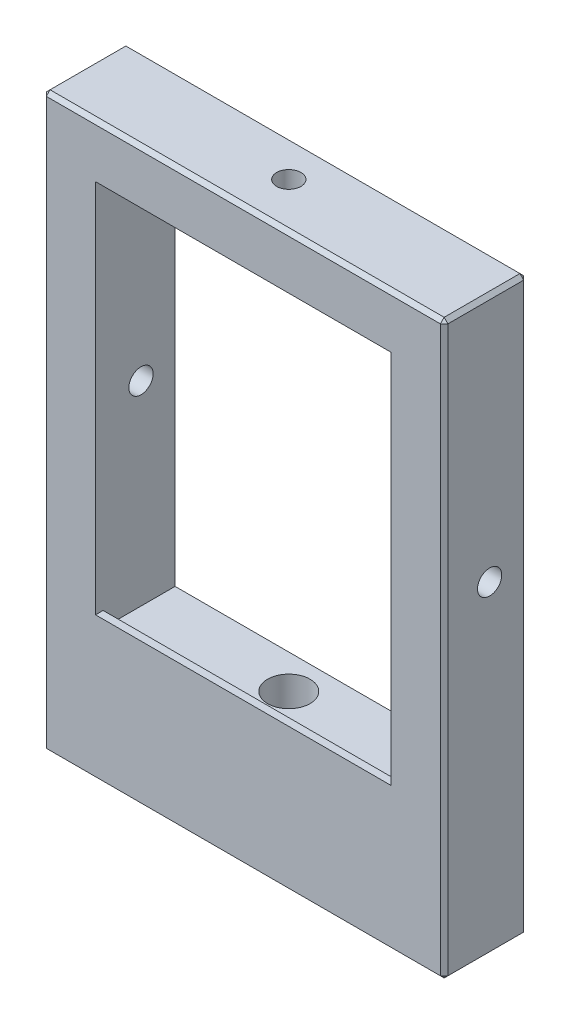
ISO-10303-21;
HEADER;
FILE_DESCRIPTION(('STEP AP214'),'2;1');
FILE_NAME('part.step','',(''),(''),'','','');
FILE_SCHEMA(('AUTOMOTIVE_DESIGN { 1 0 10303 214 1 1 1 1 }'));
ENDSEC;
DATA;
#1=APPLICATION_CONTEXT('core data for automotive mechanical design processes');
#2=APPLICATION_PROTOCOL_DEFINITION('international standard','automotive_design',2000,#1);
#3=PRODUCT_CONTEXT('',#1,'mechanical');
#4=PRODUCT('Part','Part','',(#3));
#5=PRODUCT_RELATED_PRODUCT_CATEGORY('part','',(#4));
#6=PRODUCT_DEFINITION_FORMATION('','',#4);
#7=PRODUCT_DEFINITION_CONTEXT('part definition',#1,'design');
#8=PRODUCT_DEFINITION('design','',#6,#7);
#9=PRODUCT_DEFINITION_SHAPE('','',#8);
#10=(LENGTH_UNIT() NAMED_UNIT(*) SI_UNIT(.MILLI.,.METRE.));
#11=(NAMED_UNIT(*) PLANE_ANGLE_UNIT() SI_UNIT($,.RADIAN.));
#12=(NAMED_UNIT(*) SI_UNIT($,.STERADIAN.) SOLID_ANGLE_UNIT());
#13=UNCERTAINTY_MEASURE_WITH_UNIT(LENGTH_MEASURE(1.E-05),#10,'distance_accuracy_value','');
#14=(GEOMETRIC_REPRESENTATION_CONTEXT(3) GLOBAL_UNCERTAINTY_ASSIGNED_CONTEXT((#13)) GLOBAL_UNIT_ASSIGNED_CONTEXT((#10,
#11,#12)) REPRESENTATION_CONTEXT('',''));
#15=CARTESIAN_POINT('',(0.,0.,0.));
#16=DIRECTION('',(0.,0.,1.));
#17=DIRECTION('',(1.,0.,0.));
#18=AXIS2_PLACEMENT_3D('',#15,#16,#17);
#19=CARTESIAN_POINT('',(-26.5,32.75,10.));
#20=DIRECTION('',(0.,-1.,0.));
#21=DIRECTION('',(0.,0.,-1.));
#22=AXIS2_PLACEMENT_3D('',#19,#20,#21);
#23=PLANE('',#22);
#24=DIRECTION('',(0.,0.,-1.));
#25=VECTOR('',#24,1.);
#26=CARTESIAN_POINT('',(26.,32.75,10.));
#27=LINE('',#26,#25);
#28=CARTESIAN_POINT('',(26.,32.75,10.5));
#29=VERTEX_POINT('',#28);
#30=CARTESIAN_POINT('',(26.,32.75,0.499999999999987));
#31=VERTEX_POINT('',#30);
#32=EDGE_CURVE('E312',#29,#31,#27,.T.);
#33=ORIENTED_EDGE('',*,*,#32,.T.);
#34=DIRECTION('',(-1.,0.,0.));
#35=VECTOR('',#34,1.);
#36=CARTESIAN_POINT('',(-26.5,32.75,0.499999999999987));
#37=LINE('',#36,#35);
#38=CARTESIAN_POINT('',(-26.,32.75,0.499999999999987));
#39=VERTEX_POINT('',#38);
#40=EDGE_CURVE('E314',#31,#39,#37,.T.);
#41=ORIENTED_EDGE('',*,*,#40,.T.);
#42=DIRECTION('',(0.,0.,1.));
#43=VECTOR('',#42,1.);
#44=CARTESIAN_POINT('',(-26.,32.75,10.));
#45=LINE('',#44,#43);
#46=CARTESIAN_POINT('',(-26.,32.75,10.5));
#47=VERTEX_POINT('',#46);
#48=EDGE_CURVE('E310',#39,#47,#45,.T.);
#49=ORIENTED_EDGE('',*,*,#48,.T.);
#50=DIRECTION('',(1.,0.,0.));
#51=VECTOR('',#50,1.);
#52=CARTESIAN_POINT('',(26.5,32.75,10.5));
#53=LINE('',#52,#51);
#54=EDGE_CURVE('E308',#47,#29,#53,.T.);
#55=ORIENTED_EDGE('',*,*,#54,.T.);
#56=EDGE_LOOP('',(#33,#41,#49,#55));
#57=FACE_BOUND('',#56,.T.);
#58=CARTESIAN_POINT('',(0.,32.75,5.));
#59=DIRECTION('',(0.,1.,0.));
#60=DIRECTION('',(0.,0.,1.));
#61=AXIS2_PLACEMENT_3D('',#58,#59,#60);
#62=CIRCLE('',#61,1.59999999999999);
#63=CARTESIAN_POINT('',(0.,32.75,6.59999999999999));
#64=VERTEX_POINT('',#63);
#65=EDGE_CURVE('E200',#64,#64,#62,.T.);
#66=ORIENTED_EDGE('',*,*,#65,.F.);
#67=EDGE_LOOP('',(#66));
#68=FACE_BOUND('',#67,.T.);
#69=ADVANCED_FACE('F39',(#57,#68),#23,.F.);
#70=CARTESIAN_POINT('',(0.,0.,0.));
#71=DIRECTION('',(0.,0.,-1.));
#72=DIRECTION('',(-1.,0.,0.));
#73=AXIS2_PLACEMENT_3D('',#70,#71,#72);
#74=PLANE('',#73);
#75=DIRECTION('',(-1.,0.,0.));
#76=VECTOR('',#75,1.);
#77=CARTESIAN_POINT('',(0.,26.25,0.));
#78=LINE('',#77,#76);
#79=CARTESIAN_POINT('',(20.,26.25,0.));
#80=VERTEX_POINT('',#79);
#81=CARTESIAN_POINT('',(-20.,26.25,0.));
#82=VERTEX_POINT('',#81);
#83=EDGE_CURVE('E268',#80,#82,#78,.T.);
#84=ORIENTED_EDGE('',*,*,#83,.T.);
#85=DIRECTION('',(0.,-1.,0.));
#86=VECTOR('',#85,1.);
#87=CARTESIAN_POINT('',(-20.,0.,0.));
#88=LINE('',#87,#86);
#89=CARTESIAN_POINT('',(-20.,-26.25,0.));
#90=VERTEX_POINT('',#89);
#91=EDGE_CURVE('E270',#82,#90,#88,.T.);
#92=ORIENTED_EDGE('',*,*,#91,.T.);
#93=DIRECTION('',(1.,0.,0.));
#94=VECTOR('',#93,1.);
#95=CARTESIAN_POINT('',(0.,-26.25,0.));
#96=LINE('',#95,#94);
#97=CARTESIAN_POINT('',(20.,-26.25,0.));
#98=VERTEX_POINT('',#97);
#99=EDGE_CURVE('E264',#90,#98,#96,.T.);
#100=ORIENTED_EDGE('',*,*,#99,.T.);
#101=DIRECTION('',(0.,1.,0.));
#102=VECTOR('',#101,1.);
#103=CARTESIAN_POINT('',(20.,0.,0.));
#104=LINE('',#103,#102);
#105=EDGE_CURVE('E266',#98,#80,#104,.T.);
#106=ORIENTED_EDGE('',*,*,#105,.T.);
#107=EDGE_LOOP('',(#84,#92,#100,#106));
#108=FACE_BOUND('',#107,.T.);
#109=DIRECTION('',(0.,-1.,0.));
#110=VECTOR('',#109,1.);
#111=CARTESIAN_POINT('',(26.,-42.75,0.));
#112=LINE('',#111,#110);
#113=CARTESIAN_POINT('',(26.,32.25,0.));
#114=VERTEX_POINT('',#113);
#115=CARTESIAN_POINT('',(26.,-42.25,0.));
#116=VERTEX_POINT('',#115);
#117=EDGE_CURVE('E259',#114,#116,#112,.T.);
#118=ORIENTED_EDGE('',*,*,#117,.T.);
#119=DIRECTION('',(-1.,0.,0.));
#120=VECTOR('',#119,1.);
#121=CARTESIAN_POINT('',(0.,-42.25,0.));
#122=LINE('',#121,#120);
#123=CARTESIAN_POINT('',(-26.,-42.25,0.));
#124=VERTEX_POINT('',#123);
#125=EDGE_CURVE('E261',#116,#124,#122,.T.);
#126=ORIENTED_EDGE('',*,*,#125,.T.);
#127=DIRECTION('',(0.,1.,0.));
#128=VECTOR('',#127,1.);
#129=CARTESIAN_POINT('',(-26.,32.75,0.));
#130=LINE('',#129,#128);
#131=CARTESIAN_POINT('',(-26.,32.25,0.));
#132=VERTEX_POINT('',#131);
#133=EDGE_CURVE('E257',#124,#132,#130,.T.);
#134=ORIENTED_EDGE('',*,*,#133,.T.);
#135=DIRECTION('',(1.,0.,0.));
#136=VECTOR('',#135,1.);
#137=CARTESIAN_POINT('',(26.5,32.25,0.));
#138=LINE('',#137,#136);
#139=EDGE_CURVE('E253',#132,#114,#138,.T.);
#140=ORIENTED_EDGE('',*,*,#139,.T.);
#141=EDGE_LOOP('',(#118,#126,#134,#140));
#142=FACE_BOUND('',#141,.T.);
#143=ADVANCED_FACE('F428',(#108,#142),#74,.T.);
#144=CARTESIAN_POINT('',(26.5,-32.75,10.));
#145=DIRECTION('',(-1.,0.,0.));
#146=DIRECTION('',(0.,0.,1.));
#147=AXIS2_PLACEMENT_3D('',#144,#145,#146);
#148=PLANE('',#147);
#149=DIRECTION('',(0.,-1.,0.));
#150=VECTOR('',#149,1.);
#151=CARTESIAN_POINT('',(26.5,-42.75,10.5));
#152=LINE('',#151,#150);
#153=CARTESIAN_POINT('',(26.5,32.25,10.5));
#154=VERTEX_POINT('',#153);
#155=CARTESIAN_POINT('',(26.5,-42.25,10.5));
#156=VERTEX_POINT('',#155);
#157=EDGE_CURVE('E290',#154,#156,#152,.T.);
#158=ORIENTED_EDGE('',*,*,#157,.T.);
#159=DIRECTION('',(0.,0.,-1.));
#160=VECTOR('',#159,1.);
#161=CARTESIAN_POINT('',(26.5,-42.25,0.));
#162=LINE('',#161,#160);
#163=CARTESIAN_POINT('',(26.5,-42.25,0.499999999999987));
#164=VERTEX_POINT('',#163);
#165=EDGE_CURVE('E296',#156,#164,#162,.T.);
#166=ORIENTED_EDGE('',*,*,#165,.T.);
#167=DIRECTION('',(0.,1.,0.));
#168=VECTOR('',#167,1.);
#169=CARTESIAN_POINT('',(26.5,32.75,0.499999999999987));
#170=LINE('',#169,#168);
#171=CARTESIAN_POINT('',(26.5,32.25,0.499999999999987));
#172=VERTEX_POINT('',#171);
#173=EDGE_CURVE('E294',#164,#172,#170,.T.);
#174=ORIENTED_EDGE('',*,*,#173,.T.);
#175=DIRECTION('',(0.,0.,1.));
#176=VECTOR('',#175,1.);
#177=CARTESIAN_POINT('',(26.5,32.25,10.));
#178=LINE('',#177,#176);
#179=EDGE_CURVE('E292',#172,#154,#178,.T.);
#180=ORIENTED_EDGE('',*,*,#179,.T.);
#181=EDGE_LOOP('',(#158,#166,#174,#180));
#182=FACE_BOUND('',#181,.T.);
#183=CARTESIAN_POINT('',(26.5,0.,5.));
#184=DIRECTION('',(1.,0.,0.));
#185=DIRECTION('',(0.,0.,-1.));
#186=AXIS2_PLACEMENT_3D('',#183,#184,#185);
#187=CIRCLE('',#186,1.6);
#188=CARTESIAN_POINT('',(26.5,0.,3.4));
#189=VERTEX_POINT('',#188);
#190=EDGE_CURVE('E220',#189,#189,#187,.T.);
#191=ORIENTED_EDGE('',*,*,#190,.F.);
#192=EDGE_LOOP('',(#191));
#193=FACE_BOUND('',#192,.T.);
#194=ADVANCED_FACE('F472',(#182,#193),#148,.F.);
#195=CARTESIAN_POINT('',(-26.5,-32.75,10.));
#196=DIRECTION('',(1.,0.,0.));
#197=DIRECTION('',(0.,0.,-1.));
#198=AXIS2_PLACEMENT_3D('',#195,#196,#197);
#199=PLANE('',#198);
#200=DIRECTION('',(0.,0.,-1.));
#201=VECTOR('',#200,1.);
#202=CARTESIAN_POINT('',(-26.5,32.25,10.));
#203=LINE('',#202,#201);
#204=CARTESIAN_POINT('',(-26.5,32.25,10.5));
#205=VERTEX_POINT('',#204);
#206=CARTESIAN_POINT('',(-26.5,32.25,0.5));
#207=VERTEX_POINT('',#206);
#208=EDGE_CURVE('E303',#205,#207,#203,.T.);
#209=ORIENTED_EDGE('',*,*,#208,.T.);
#210=DIRECTION('',(0.,-1.,0.));
#211=VECTOR('',#210,1.);
#212=CARTESIAN_POINT('',(-26.5,-42.75,0.5));
#213=LINE('',#212,#211);
#214=CARTESIAN_POINT('',(-26.5,-42.25,0.5));
#215=VERTEX_POINT('',#214);
#216=EDGE_CURVE('E305',#207,#215,#213,.T.);
#217=ORIENTED_EDGE('',*,*,#216,.T.);
#218=DIRECTION('',(0.,0.,1.));
#219=VECTOR('',#218,1.);
#220=CARTESIAN_POINT('',(-26.5,-42.25,11.));
#221=LINE('',#220,#219);
#222=CARTESIAN_POINT('',(-26.5,-42.25,10.5));
#223=VERTEX_POINT('',#222);
#224=EDGE_CURVE('E301',#215,#223,#221,.T.);
#225=ORIENTED_EDGE('',*,*,#224,.T.);
#226=DIRECTION('',(0.,1.,0.));
#227=VECTOR('',#226,1.);
#228=CARTESIAN_POINT('',(-26.5,32.75,10.5));
#229=LINE('',#228,#227);
#230=EDGE_CURVE('E299',#223,#205,#229,.T.);
#231=ORIENTED_EDGE('',*,*,#230,.T.);
#232=EDGE_LOOP('',(#209,#217,#225,#231));
#233=FACE_BOUND('',#232,.T.);
#234=CARTESIAN_POINT('',(-26.5,0.,5.));
#235=DIRECTION('',(1.,0.,0.));
#236=DIRECTION('',(0.,0.,-1.));
#237=AXIS2_PLACEMENT_3D('',#234,#235,#236);
#238=CIRCLE('',#237,1.59999999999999);
#239=CARTESIAN_POINT('',(-26.5,0.,3.40000000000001));
#240=VERTEX_POINT('',#239);
#241=EDGE_CURVE('E223',#240,#240,#238,.T.);
#242=ORIENTED_EDGE('',*,*,#241,.T.);
#243=EDGE_LOOP('',(#242));
#244=FACE_BOUND('',#243,.T.);
#245=ADVANCED_FACE('F444',(#233,#244),#199,.F.);
#246=CARTESIAN_POINT('',(19.5,-25.75,10.));
#247=DIRECTION('',(-1.,0.,0.));
#248=DIRECTION('',(0.,0.,1.));
#249=AXIS2_PLACEMENT_3D('',#246,#247,#248);
#250=PLANE('',#249);
#251=CARTESIAN_POINT('',(19.5,0.,5.));
#252=DIRECTION('',(-1.,0.,0.));
#253=DIRECTION('',(0.,0.,1.));
#254=AXIS2_PLACEMENT_3D('',#251,#252,#253);
#255=CIRCLE('',#254,1.6);
#256=CARTESIAN_POINT('',(19.5,0.,6.6));
#257=VERTEX_POINT('',#256);
#258=EDGE_CURVE('E227',#257,#257,#255,.T.);
#259=ORIENTED_EDGE('',*,*,#258,.F.);
#260=EDGE_LOOP('',(#259));
#261=FACE_BOUND('',#260,.T.);
#262=DIRECTION('',(0.,0.,-1.));
#263=VECTOR('',#262,1.);
#264=CARTESIAN_POINT('',(19.5,25.75,10.));
#265=LINE('',#264,#263);
#266=CARTESIAN_POINT('',(19.5,25.75,11.));
#267=VERTEX_POINT('',#266);
#268=CARTESIAN_POINT('',(19.5,25.75,0.5));
#269=VERTEX_POINT('',#268);
#270=EDGE_CURVE('E250',#267,#269,#265,.T.);
#271=ORIENTED_EDGE('',*,*,#270,.T.);
#272=DIRECTION('',(0.,-1.,0.));
#273=VECTOR('',#272,1.);
#274=CARTESIAN_POINT('',(19.5,-25.75,0.5));
#275=LINE('',#274,#273);
#276=CARTESIAN_POINT('',(19.5,-25.75,0.5));
#277=VERTEX_POINT('',#276);
#278=EDGE_CURVE('E277',#269,#277,#275,.T.);
#279=ORIENTED_EDGE('',*,*,#278,.T.);
#280=DIRECTION('',(0.,0.,-1.));
#281=VECTOR('',#280,1.);
#282=CARTESIAN_POINT('',(19.5,-25.75,10.));
#283=LINE('',#282,#281);
#284=CARTESIAN_POINT('',(19.5,-25.75,10.));
#285=VERTEX_POINT('',#284);
#286=EDGE_CURVE('E244',#285,#277,#283,.T.);
#287=ORIENTED_EDGE('',*,*,#286,.F.);
#288=DIRECTION('',(0.,1.,0.));
#289=VECTOR('',#288,1.);
#290=CARTESIAN_POINT('',(19.5,-25.75,10.));
#291=LINE('',#290,#289);
#292=CARTESIAN_POINT('',(19.5,-23.75,10.));
#293=VERTEX_POINT('',#292);
#294=EDGE_CURVE('E236',#285,#293,#291,.T.);
#295=ORIENTED_EDGE('',*,*,#294,.T.);
#296=DIRECTION('',(0.,0.,-1.));
#297=VECTOR('',#296,1.);
#298=CARTESIAN_POINT('',(19.5,-23.75,11.));
#299=LINE('',#298,#297);
#300=CARTESIAN_POINT('',(19.5,-23.75,11.));
#301=VERTEX_POINT('',#300);
#302=EDGE_CURVE('E201',#301,#293,#299,.T.);
#303=ORIENTED_EDGE('',*,*,#302,.F.);
#304=DIRECTION('',(0.,1.,0.));
#305=VECTOR('',#304,1.);
#306=CARTESIAN_POINT('',(19.5,25.75,11.));
#307=LINE('',#306,#305);
#308=EDGE_CURVE('E206',#301,#267,#307,.T.);
#309=ORIENTED_EDGE('',*,*,#308,.T.);
#310=EDGE_LOOP('',(#271,#279,#287,#295,#303,#309));
#311=FACE_BOUND('',#310,.T.);
#312=ADVANCED_FACE('F742',(#261,#311),#250,.T.);
#313=CARTESIAN_POINT('',(-19.5,25.75,10.));
#314=DIRECTION('',(0.,-1.,0.));
#315=DIRECTION('',(0.,0.,-1.));
#316=AXIS2_PLACEMENT_3D('',#313,#314,#315);
#317=PLANE('',#316);
#318=CARTESIAN_POINT('',(0.,25.75,5.));
#319=DIRECTION('',(0.,-1.,0.));
#320=DIRECTION('',(0.,0.,-1.));
#321=AXIS2_PLACEMENT_3D('',#318,#319,#320);
#322=CIRCLE('',#321,1.59999999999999);
#323=CARTESIAN_POINT('',(0.,25.75,3.40000000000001));
#324=VERTEX_POINT('',#323);
#325=EDGE_CURVE('E217',#324,#324,#322,.T.);
#326=ORIENTED_EDGE('',*,*,#325,.F.);
#327=EDGE_LOOP('',(#326));
#328=FACE_BOUND('',#327,.T.);
#329=DIRECTION('',(0.,0.,-1.));
#330=VECTOR('',#329,1.);
#331=CARTESIAN_POINT('',(-19.5,25.75,10.));
#332=LINE('',#331,#330);
#333=CARTESIAN_POINT('',(-19.5,25.75,11.));
#334=VERTEX_POINT('',#333);
#335=CARTESIAN_POINT('',(-19.5,25.75,0.5));
#336=VERTEX_POINT('',#335);
#337=EDGE_CURVE('E187',#334,#336,#332,.T.);
#338=ORIENTED_EDGE('',*,*,#337,.T.);
#339=DIRECTION('',(1.,0.,0.));
#340=VECTOR('',#339,1.);
#341=CARTESIAN_POINT('',(-19.5,25.75,0.5));
#342=LINE('',#341,#340);
#343=EDGE_CURVE('E275',#336,#269,#342,.T.);
#344=ORIENTED_EDGE('',*,*,#343,.T.);
#345=ORIENTED_EDGE('',*,*,#270,.F.);
#346=DIRECTION('',(-1.,0.,0.));
#347=VECTOR('',#346,1.);
#348=CARTESIAN_POINT('',(-19.5,25.75,11.));
#349=LINE('',#348,#347);
#350=EDGE_CURVE('E208',#267,#334,#349,.T.);
#351=ORIENTED_EDGE('',*,*,#350,.T.);
#352=EDGE_LOOP('',(#338,#344,#345,#351));
#353=FACE_BOUND('',#352,.T.);
#354=ADVANCED_FACE('F751',(#328,#353),#317,.T.);
#355=CARTESIAN_POINT('',(-19.5,-25.75,10.));
#356=DIRECTION('',(1.,0.,0.));
#357=DIRECTION('',(0.,0.,-1.));
#358=AXIS2_PLACEMENT_3D('',#355,#356,#357);
#359=PLANE('',#358);
#360=CARTESIAN_POINT('',(-19.5,0.,5.));
#361=DIRECTION('',(1.,0.,0.));
#362=DIRECTION('',(0.,0.,-1.));
#363=AXIS2_PLACEMENT_3D('',#360,#361,#362);
#364=CIRCLE('',#363,1.6);
#365=CARTESIAN_POINT('',(-19.5,0.,3.4));
#366=VERTEX_POINT('',#365);
#367=EDGE_CURVE('E226',#366,#366,#364,.T.);
#368=ORIENTED_EDGE('',*,*,#367,.F.);
#369=EDGE_LOOP('',(#368));
#370=FACE_BOUND('',#369,.T.);
#371=DIRECTION('',(0.,0.,-1.));
#372=VECTOR('',#371,1.);
#373=CARTESIAN_POINT('',(-19.5,-25.75,10.));
#374=LINE('',#373,#372);
#375=CARTESIAN_POINT('',(-19.5,-25.75,10.));
#376=VERTEX_POINT('',#375);
#377=CARTESIAN_POINT('',(-19.5,-25.75,0.5));
#378=VERTEX_POINT('',#377);
#379=EDGE_CURVE('E247',#376,#378,#374,.T.);
#380=ORIENTED_EDGE('',*,*,#379,.T.);
#381=DIRECTION('',(0.,1.,0.));
#382=VECTOR('',#381,1.);
#383=CARTESIAN_POINT('',(-19.5,-25.75,0.5));
#384=LINE('',#383,#382);
#385=EDGE_CURVE('E273',#378,#336,#384,.T.);
#386=ORIENTED_EDGE('',*,*,#385,.T.);
#387=ORIENTED_EDGE('',*,*,#337,.F.);
#388=DIRECTION('',(0.,-1.,0.));
#389=VECTOR('',#388,1.);
#390=CARTESIAN_POINT('',(-19.5,25.75,11.));
#391=LINE('',#390,#389);
#392=CARTESIAN_POINT('',(-19.5,-23.75,11.));
#393=VERTEX_POINT('',#392);
#394=EDGE_CURVE('E179',#334,#393,#391,.T.);
#395=ORIENTED_EDGE('',*,*,#394,.T.);
#396=DIRECTION('',(0.,0.,-1.));
#397=VECTOR('',#396,1.);
#398=CARTESIAN_POINT('',(-19.5,-23.75,11.));
#399=LINE('',#398,#397);
#400=CARTESIAN_POINT('',(-19.5,-23.75,10.));
#401=VERTEX_POINT('',#400);
#402=EDGE_CURVE('E184',#393,#401,#399,.T.);
#403=ORIENTED_EDGE('',*,*,#402,.T.);
#404=DIRECTION('',(0.,-1.,0.));
#405=VECTOR('',#404,1.);
#406=CARTESIAN_POINT('',(-19.5,-25.75,10.));
#407=LINE('',#406,#405);
#408=EDGE_CURVE('E239',#401,#376,#407,.T.);
#409=ORIENTED_EDGE('',*,*,#408,.T.);
#410=EDGE_LOOP('',(#380,#386,#387,#395,#403,#409));
#411=FACE_BOUND('',#410,.T.);
#412=ADVANCED_FACE('F182',(#370,#411),#359,.T.);
#413=CARTESIAN_POINT('',(-19.5,-25.75,10.));
#414=DIRECTION('',(0.,1.,0.));
#415=DIRECTION('',(0.,0.,1.));
#416=AXIS2_PLACEMENT_3D('',#413,#414,#415);
#417=PLANE('',#416);
#418=CARTESIAN_POINT('',(0.,-25.75,5.));
#419=DIRECTION('',(0.,1.,0.));
#420=DIRECTION('',(0.,0.,1.));
#421=AXIS2_PLACEMENT_3D('',#418,#419,#420);
#422=CIRCLE('',#421,2.79999999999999);
#423=CARTESIAN_POINT('',(0.,-25.75,7.79999999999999));
#424=VERTEX_POINT('',#423);
#425=EDGE_CURVE('E233',#424,#424,#422,.T.);
#426=ORIENTED_EDGE('',*,*,#425,.F.);
#427=EDGE_LOOP('',(#426));
#428=FACE_BOUND('',#427,.T.);
#429=ORIENTED_EDGE('',*,*,#286,.T.);
#430=DIRECTION('',(-1.,0.,0.));
#431=VECTOR('',#430,1.);
#432=CARTESIAN_POINT('',(-19.5,-25.75,0.5));
#433=LINE('',#432,#431);
#434=EDGE_CURVE('E279',#277,#378,#433,.T.);
#435=ORIENTED_EDGE('',*,*,#434,.T.);
#436=ORIENTED_EDGE('',*,*,#379,.F.);
#437=DIRECTION('',(1.,0.,0.));
#438=VECTOR('',#437,1.);
#439=CARTESIAN_POINT('',(-19.5,-25.75,10.));
#440=LINE('',#439,#438);
#441=EDGE_CURVE('E241',#376,#285,#440,.T.);
#442=ORIENTED_EDGE('',*,*,#441,.T.);
#443=EDGE_LOOP('',(#429,#435,#436,#442));
#444=FACE_BOUND('',#443,.T.);
#445=ADVANCED_FACE('F709',(#428,#444),#417,.T.);
#446=CARTESIAN_POINT('',(0.,-42.75,0.));
#447=DIRECTION('',(0.,-1.,0.));
#448=DIRECTION('',(0.,0.,-1.));
#449=AXIS2_PLACEMENT_3D('',#446,#447,#448);
#450=PLANE('',#449);
#451=DIRECTION('',(1.,0.,0.));
#452=VECTOR('',#451,1.);
#453=CARTESIAN_POINT('',(0.,-42.75,0.499999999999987));
#454=LINE('',#453,#452);
#455=CARTESIAN_POINT('',(-26.,-42.75,0.499999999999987));
#456=VERTEX_POINT('',#455);
#457=CARTESIAN_POINT('',(26.,-42.75,0.499999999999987));
#458=VERTEX_POINT('',#457);
#459=EDGE_CURVE('E285',#456,#458,#454,.T.);
#460=ORIENTED_EDGE('',*,*,#459,.T.);
#461=DIRECTION('',(0.,0.,1.));
#462=VECTOR('',#461,1.);
#463=CARTESIAN_POINT('',(26.,-42.75,11.));
#464=LINE('',#463,#462);
#465=CARTESIAN_POINT('',(26.,-42.75,10.5));
#466=VERTEX_POINT('',#465);
#467=EDGE_CURVE('E287',#458,#466,#464,.T.);
#468=ORIENTED_EDGE('',*,*,#467,.T.);
#469=DIRECTION('',(-1.,0.,0.));
#470=VECTOR('',#469,1.);
#471=CARTESIAN_POINT('',(0.,-42.75,10.5));
#472=LINE('',#471,#470);
#473=CARTESIAN_POINT('',(-26.,-42.75,10.5));
#474=VERTEX_POINT('',#473);
#475=EDGE_CURVE('E281',#466,#474,#472,.T.);
#476=ORIENTED_EDGE('',*,*,#475,.T.);
#477=DIRECTION('',(0.,0.,-1.));
#478=VECTOR('',#477,1.);
#479=CARTESIAN_POINT('',(-26.,-42.75,0.));
#480=LINE('',#479,#478);
#481=EDGE_CURVE('E283',#474,#456,#480,.T.);
#482=ORIENTED_EDGE('',*,*,#481,.T.);
#483=EDGE_LOOP('',(#460,#468,#476,#482));
#484=FACE_BOUND('',#483,.T.);
#485=CARTESIAN_POINT('',(0.,-42.75,5.));
#486=DIRECTION('',(0.,-1.,0.));
#487=DIRECTION('',(0.,0.,-1.));
#488=AXIS2_PLACEMENT_3D('',#485,#486,#487);
#489=CIRCLE('',#488,2.79999999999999);
#490=CARTESIAN_POINT('',(0.,-42.75,2.20000000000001));
#491=VERTEX_POINT('',#490);
#492=EDGE_CURVE('E230',#491,#491,#489,.T.);
#493=ORIENTED_EDGE('',*,*,#492,.F.);
#494=EDGE_LOOP('',(#493));
#495=FACE_BOUND('',#494,.T.);
#496=ADVANCED_FACE('F700',(#484,#495),#450,.T.);
#497=CARTESIAN_POINT('',(0.,-42.75,5.));
#498=DIRECTION('',(0.,-1.,0.));
#499=DIRECTION('',(0.,0.,-1.));
#500=AXIS2_PLACEMENT_3D('',#497,#498,#499);
#501=CYLINDRICAL_SURFACE('',#500,2.79999999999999);
#502=ORIENTED_EDGE('',*,*,#492,.T.);
#503=EDGE_LOOP('',(#502));
#504=FACE_BOUND('',#503,.T.);
#505=ORIENTED_EDGE('',*,*,#425,.T.);
#506=EDGE_LOOP('',(#505));
#507=FACE_BOUND('',#506,.T.);
#508=ADVANCED_FACE('F691',(#504,#507),#501,.F.);
#509=CARTESIAN_POINT('',(26.5,0.,5.));
#510=DIRECTION('',(1.,0.,0.));
#511=DIRECTION('',(0.,0.,-1.));
#512=AXIS2_PLACEMENT_3D('',#509,#510,#511);
#513=CYLINDRICAL_SURFACE('',#512,1.6);
#514=ORIENTED_EDGE('',*,*,#367,.T.);
#515=EDGE_LOOP('',(#514));
#516=FACE_BOUND('',#515,.T.);
#517=ORIENTED_EDGE('',*,*,#241,.F.);
#518=EDGE_LOOP('',(#517));
#519=FACE_BOUND('',#518,.T.);
#520=ADVANCED_FACE('F680',(#516,#519),#513,.F.);
#521=ORIENTED_EDGE('',*,*,#258,.T.);
#522=EDGE_LOOP('',(#521));
#523=FACE_BOUND('',#522,.T.);
#524=ORIENTED_EDGE('',*,*,#190,.T.);
#525=EDGE_LOOP('',(#524));
#526=FACE_BOUND('',#525,.T.);
#527=ADVANCED_FACE('F491',(#523,#526),#513,.F.);
#528=CARTESIAN_POINT('',(0.,32.75,5.));
#529=DIRECTION('',(0.,1.,0.));
#530=DIRECTION('',(0.,0.,1.));
#531=AXIS2_PLACEMENT_3D('',#528,#529,#530);
#532=CYLINDRICAL_SURFACE('',#531,1.59999999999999);
#533=ORIENTED_EDGE('',*,*,#65,.T.);
#534=EDGE_LOOP('',(#533));
#535=FACE_BOUND('',#534,.T.);
#536=ORIENTED_EDGE('',*,*,#325,.T.);
#537=EDGE_LOOP('',(#536));
#538=FACE_BOUND('',#537,.T.);
#539=ADVANCED_FACE('F482',(#535,#538),#532,.F.);
#540=CARTESIAN_POINT('',(0.,0.,11.));
#541=DIRECTION('',(0.,0.,1.));
#542=DIRECTION('',(1.,0.,0.));
#543=AXIS2_PLACEMENT_3D('',#540,#541,#542);
#544=PLANE('',#543);
#545=DIRECTION('',(1.,0.,0.));
#546=VECTOR('',#545,1.);
#547=CARTESIAN_POINT('',(0.,-42.25,11.));
#548=LINE('',#547,#546);
#549=CARTESIAN_POINT('',(-26.,-42.25,11.));
#550=VERTEX_POINT('',#549);
#551=CARTESIAN_POINT('',(26.,-42.25,11.));
#552=VERTEX_POINT('',#551);
#553=EDGE_CURVE('E49',#550,#552,#548,.T.);
#554=ORIENTED_EDGE('',*,*,#553,.T.);
#555=DIRECTION('',(0.,1.,0.));
#556=VECTOR('',#555,1.);
#557=CARTESIAN_POINT('',(26.,32.75,11.));
#558=LINE('',#557,#556);
#559=CARTESIAN_POINT('',(26.,32.25,11.));
#560=VERTEX_POINT('',#559);
#561=EDGE_CURVE('E11',#552,#560,#558,.T.);
#562=ORIENTED_EDGE('',*,*,#561,.T.);
#563=DIRECTION('',(-1.,0.,0.));
#564=VECTOR('',#563,1.);
#565=CARTESIAN_POINT('',(-26.5,32.25,11.));
#566=LINE('',#565,#564);
#567=CARTESIAN_POINT('',(-26.,32.25,11.));
#568=VERTEX_POINT('',#567);
#569=EDGE_CURVE('E319',#560,#568,#566,.T.);
#570=ORIENTED_EDGE('',*,*,#569,.T.);
#571=DIRECTION('',(0.,-1.,0.));
#572=VECTOR('',#571,1.);
#573=CARTESIAN_POINT('',(-26.,-42.75,11.));
#574=LINE('',#573,#572);
#575=EDGE_CURVE('E317',#568,#550,#574,.T.);
#576=ORIENTED_EDGE('',*,*,#575,.T.);
#577=EDGE_LOOP('',(#554,#562,#570,#576));
#578=FACE_BOUND('',#577,.T.);
#579=DIRECTION('',(1.,0.,0.));
#580=VECTOR('',#579,1.);
#581=CARTESIAN_POINT('',(-19.5,-23.75,11.));
#582=LINE('',#581,#580);
#583=EDGE_CURVE('E192',#393,#301,#582,.T.);
#584=ORIENTED_EDGE('',*,*,#583,.F.);
#585=ORIENTED_EDGE('',*,*,#394,.F.);
#586=ORIENTED_EDGE('',*,*,#350,.F.);
#587=ORIENTED_EDGE('',*,*,#308,.F.);
#588=EDGE_LOOP('',(#584,#585,#586,#587));
#589=FACE_BOUND('',#588,.T.);
#590=ADVANCED_FACE('F204',(#578,#589),#544,.T.);
#591=CARTESIAN_POINT('',(0.,0.,10.));
#592=DIRECTION('',(0.,0.,1.));
#593=DIRECTION('',(1.,0.,0.));
#594=AXIS2_PLACEMENT_3D('',#591,#592,#593);
#595=PLANE('',#594);
#596=ORIENTED_EDGE('',*,*,#294,.F.);
#597=ORIENTED_EDGE('',*,*,#441,.F.);
#598=ORIENTED_EDGE('',*,*,#408,.F.);
#599=DIRECTION('',(1.,0.,0.));
#600=VECTOR('',#599,1.);
#601=CARTESIAN_POINT('',(-19.5,-23.75,10.));
#602=LINE('',#601,#600);
#603=EDGE_CURVE('E193',#401,#293,#602,.T.);
#604=ORIENTED_EDGE('',*,*,#603,.T.);
#605=EDGE_LOOP('',(#596,#597,#598,#604));
#606=FACE_BOUND('',#605,.T.);
#607=ADVANCED_FACE('F481',(#606),#595,.F.);
#608=CARTESIAN_POINT('',(-19.5,-23.75,11.));
#609=DIRECTION('',(0.,1.,0.));
#610=DIRECTION('',(0.,0.,1.));
#611=AXIS2_PLACEMENT_3D('',#608,#609,#610);
#612=PLANE('',#611);
#613=ORIENTED_EDGE('',*,*,#603,.F.);
#614=ORIENTED_EDGE('',*,*,#402,.F.);
#615=ORIENTED_EDGE('',*,*,#583,.T.);
#616=ORIENTED_EDGE('',*,*,#302,.T.);
#617=EDGE_LOOP('',(#613,#614,#615,#616));
#618=FACE_BOUND('',#617,.T.);
#619=ADVANCED_FACE('F197',(#618),#612,.T.);
#620=CARTESIAN_POINT('',(20.,0.,0.));
#621=DIRECTION('',(0.707106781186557,0.,0.707106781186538));
#622=DIRECTION('',(0.,1.,0.));
#623=AXIS2_PLACEMENT_3D('',#620,#621,#622);
#624=PLANE('',#623);
#625=DIRECTION('',(0.57735026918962,-0.57735026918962,-0.577350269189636));
#626=VECTOR('',#625,1.);
#627=CARTESIAN_POINT('',(11.2500000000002,-17.5000000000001,8.75000000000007));
#628=LINE('',#627,#626);
#629=EDGE_CURVE('E326',#277,#98,#628,.T.);
#630=ORIENTED_EDGE('',*,*,#629,.F.);
#631=ORIENTED_EDGE('',*,*,#278,.F.);
#632=DIRECTION('',(0.57735026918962,0.57735026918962,-0.577350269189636));
#633=VECTOR('',#632,1.);
#634=CARTESIAN_POINT('',(13.3333333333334,19.5833333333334,6.66666666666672));
#635=LINE('',#634,#633);
#636=EDGE_CURVE('E213',#80,#269,#635,.F.);
#637=ORIENTED_EDGE('',*,*,#636,.F.);
#638=ORIENTED_EDGE('',*,*,#105,.F.);
#639=EDGE_LOOP('',(#630,#631,#637,#638));
#640=FACE_BOUND('',#639,.T.);
#641=ADVANCED_FACE('F527',(#640),#624,.F.);
#642=CARTESIAN_POINT('',(0.,26.25,0.));
#643=DIRECTION('',(0.,0.707106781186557,0.707106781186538));
#644=DIRECTION('',(-1.,0.,0.));
#645=AXIS2_PLACEMENT_3D('',#642,#643,#644);
#646=PLANE('',#645);
#647=ORIENTED_EDGE('',*,*,#636,.T.);
#648=ORIENTED_EDGE('',*,*,#343,.F.);
#649=DIRECTION('',(-0.57735026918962,0.57735026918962,-0.577350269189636));
#650=VECTOR('',#649,1.);
#651=CARTESIAN_POINT('',(-11.2500000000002,17.5000000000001,8.75000000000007));
#652=LINE('',#651,#650);
#653=EDGE_CURVE('E324',#82,#336,#652,.F.);
#654=ORIENTED_EDGE('',*,*,#653,.F.);
#655=ORIENTED_EDGE('',*,*,#83,.F.);
#656=EDGE_LOOP('',(#647,#648,#654,#655));
#657=FACE_BOUND('',#656,.T.);
#658=ADVANCED_FACE('F520',(#657),#646,.F.);
#659=CARTESIAN_POINT('',(0.,-26.25,0.));
#660=DIRECTION('',(0.,-0.707106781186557,0.707106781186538));
#661=DIRECTION('',(1.,0.,0.));
#662=AXIS2_PLACEMENT_3D('',#659,#660,#661);
#663=PLANE('',#662);
#664=ORIENTED_EDGE('',*,*,#629,.T.);
#665=ORIENTED_EDGE('',*,*,#99,.F.);
#666=DIRECTION('',(0.57735026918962,0.57735026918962,0.577350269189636));
#667=VECTOR('',#666,1.);
#668=CARTESIAN_POINT('',(-11.2500000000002,-17.5000000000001,8.75000000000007));
#669=LINE('',#668,#667);
#670=EDGE_CURVE('E322',#378,#90,#669,.F.);
#671=ORIENTED_EDGE('',*,*,#670,.F.);
#672=ORIENTED_EDGE('',*,*,#434,.F.);
#673=EDGE_LOOP('',(#664,#665,#671,#672));
#674=FACE_BOUND('',#673,.T.);
#675=ADVANCED_FACE('F513',(#674),#663,.F.);
#676=CARTESIAN_POINT('',(-20.,0.,0.));
#677=DIRECTION('',(-0.707106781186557,0.,0.707106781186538));
#678=DIRECTION('',(0.,-1.,0.));
#679=AXIS2_PLACEMENT_3D('',#676,#677,#678);
#680=PLANE('',#679);
#681=ORIENTED_EDGE('',*,*,#653,.T.);
#682=ORIENTED_EDGE('',*,*,#385,.F.);
#683=ORIENTED_EDGE('',*,*,#670,.T.);
#684=ORIENTED_EDGE('',*,*,#91,.F.);
#685=EDGE_LOOP('',(#681,#682,#683,#684));
#686=FACE_BOUND('',#685,.T.);
#687=ADVANCED_FACE('F507',(#686),#680,.F.);
#688=CARTESIAN_POINT('',(-26.5,32.25,10.));
#689=DIRECTION('',(0.707106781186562,-0.707106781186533,0.));
#690=DIRECTION('',(0.,0.,-1.));
#691=AXIS2_PLACEMENT_3D('',#688,#689,#690);
#692=PLANE('',#691);
#693=DIRECTION('',(-0.707106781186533,-0.707106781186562,0.));
#694=VECTOR('',#693,1.);
#695=CARTESIAN_POINT('',(-26.25,32.5,0.499999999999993));
#696=LINE('',#695,#694);
#697=EDGE_CURVE('E44',#207,#39,#696,.F.);
#698=ORIENTED_EDGE('',*,*,#697,.F.);
#699=ORIENTED_EDGE('',*,*,#208,.F.);
#700=DIRECTION('',(0.707106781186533,0.707106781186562,0.));
#701=VECTOR('',#700,1.);
#702=CARTESIAN_POINT('',(-26.,32.75,10.5));
#703=LINE('',#702,#701);
#704=EDGE_CURVE('E388',#47,#205,#703,.F.);
#705=ORIENTED_EDGE('',*,*,#704,.F.);
#706=ORIENTED_EDGE('',*,*,#48,.F.);
#707=EDGE_LOOP('',(#698,#699,#705,#706));
#708=FACE_BOUND('',#707,.T.);
#709=ADVANCED_FACE('F42',(#708),#692,.F.);
#710=CARTESIAN_POINT('',(-26.,32.25,0.));
#711=DIRECTION('',(-0.577350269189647,0.577350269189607,-0.577350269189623));
#712=DIRECTION('',(-0.707106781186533,0.,0.707106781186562));
#713=AXIS2_PLACEMENT_3D('',#710,#711,#712);
#714=PLANE('',#713);
#715=DIRECTION('',(-0.707106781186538,0.,0.707106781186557));
#716=VECTOR('',#715,1.);
#717=CARTESIAN_POINT('',(-26.,32.25,0.));
#718=LINE('',#717,#716);
#719=EDGE_CURVE('E384',#207,#132,#718,.F.);
#720=ORIENTED_EDGE('',*,*,#719,.F.);
#721=ORIENTED_EDGE('',*,*,#697,.T.);
#722=DIRECTION('',(0.,-0.707106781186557,-0.707106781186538));
#723=VECTOR('',#722,1.);
#724=CARTESIAN_POINT('',(-26.,32.25,0.));
#725=LINE('',#724,#723);
#726=EDGE_CURVE('E387',#132,#39,#725,.F.);
#727=ORIENTED_EDGE('',*,*,#726,.F.);
#728=EDGE_LOOP('',(#720,#721,#727));
#729=FACE_BOUND('',#728,.T.);
#730=ADVANCED_FACE('F400',(#729),#714,.T.);
#731=CARTESIAN_POINT('',(-26.,32.75,10.5));
#732=DIRECTION('',(-0.577350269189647,0.577350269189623,0.577350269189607));
#733=DIRECTION('',(-0.707106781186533,-0.707106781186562,0.));
#734=AXIS2_PLACEMENT_3D('',#731,#732,#733);
#735=PLANE('',#734);
#736=DIRECTION('',(0.,0.707106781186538,-0.707106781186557));
#737=VECTOR('',#736,1.);
#738=CARTESIAN_POINT('',(-26.,32.75,10.5));
#739=LINE('',#738,#737);
#740=EDGE_CURVE('E378',#47,#568,#739,.F.);
#741=ORIENTED_EDGE('',*,*,#740,.F.);
#742=ORIENTED_EDGE('',*,*,#704,.T.);
#743=DIRECTION('',(0.707106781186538,0.,0.707106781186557));
#744=VECTOR('',#743,1.);
#745=CARTESIAN_POINT('',(-26.25,32.25,10.75));
#746=LINE('',#745,#744);
#747=EDGE_CURVE('E381',#568,#205,#746,.F.);
#748=ORIENTED_EDGE('',*,*,#747,.F.);
#749=EDGE_LOOP('',(#741,#742,#748));
#750=FACE_BOUND('',#749,.T.);
#751=ADVANCED_FACE('F622',(#750),#735,.T.);
#752=CARTESIAN_POINT('',(-26.5,32.75,0.499999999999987));
#753=DIRECTION('',(0.,0.707106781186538,-0.707106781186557));
#754=DIRECTION('',(1.,0.,0.));
#755=AXIS2_PLACEMENT_3D('',#752,#753,#754);
#756=PLANE('',#755);
#757=ORIENTED_EDGE('',*,*,#726,.T.);
#758=ORIENTED_EDGE('',*,*,#40,.F.);
#759=DIRECTION('',(0.,0.707106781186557,0.707106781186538));
#760=VECTOR('',#759,1.);
#761=CARTESIAN_POINT('',(26.,32.5,0.249999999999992));
#762=LINE('',#761,#760);
#763=EDGE_CURVE('E372',#114,#31,#762,.T.);
#764=ORIENTED_EDGE('',*,*,#763,.F.);
#765=ORIENTED_EDGE('',*,*,#139,.F.);
#766=EDGE_LOOP('',(#757,#758,#764,#765));
#767=FACE_BOUND('',#766,.T.);
#768=ADVANCED_FACE('F412',(#767),#756,.T.);
#769=CARTESIAN_POINT('',(-26.5,-32.75,0.5));
#770=DIRECTION('',(-0.707106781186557,0.,-0.707106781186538));
#771=DIRECTION('',(0.,1.,0.));
#772=AXIS2_PLACEMENT_3D('',#769,#770,#771);
#773=PLANE('',#772);
#774=ORIENTED_EDGE('',*,*,#719,.T.);
#775=ORIENTED_EDGE('',*,*,#133,.F.);
#776=DIRECTION('',(0.707106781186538,0.,-0.707106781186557));
#777=VECTOR('',#776,1.);
#778=CARTESIAN_POINT('',(-26.,-42.25,0.));
#779=LINE('',#778,#777);
#780=EDGE_CURVE('E369',#215,#124,#779,.T.);
#781=ORIENTED_EDGE('',*,*,#780,.F.);
#782=ORIENTED_EDGE('',*,*,#216,.F.);
#783=EDGE_LOOP('',(#774,#775,#781,#782));
#784=FACE_BOUND('',#783,.T.);
#785=ADVANCED_FACE('F442',(#784),#773,.T.);
#786=CARTESIAN_POINT('',(-26.,-42.75,0.));
#787=DIRECTION('',(-0.707106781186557,-0.707106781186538,0.));
#788=DIRECTION('',(0.,0.,1.));
#789=AXIS2_PLACEMENT_3D('',#786,#787,#788);
#790=PLANE('',#789);
#791=DIRECTION('',(0.707106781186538,-0.707106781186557,0.));
#792=VECTOR('',#791,1.);
#793=CARTESIAN_POINT('',(-26.5,-42.25,10.5));
#794=LINE('',#793,#792);
#795=EDGE_CURVE('E364',#223,#474,#794,.T.);
#796=ORIENTED_EDGE('',*,*,#795,.F.);
#797=ORIENTED_EDGE('',*,*,#224,.F.);
#798=DIRECTION('',(-0.707106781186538,0.707106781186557,0.));
#799=VECTOR('',#798,1.);
#800=CARTESIAN_POINT('',(-26.25,-42.5,0.499999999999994));
#801=LINE('',#800,#799);
#802=EDGE_CURVE('E367',#456,#215,#801,.T.);
#803=ORIENTED_EDGE('',*,*,#802,.F.);
#804=ORIENTED_EDGE('',*,*,#481,.F.);
#805=EDGE_LOOP('',(#796,#797,#803,#804));
#806=FACE_BOUND('',#805,.T.);
#807=ADVANCED_FACE('F455',(#806),#790,.T.);
#808=CARTESIAN_POINT('',(-26.,0.,11.));
#809=DIRECTION('',(-0.707106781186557,0.,0.707106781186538));
#810=DIRECTION('',(0.,1.,0.));
#811=AXIS2_PLACEMENT_3D('',#808,#809,#810);
#812=PLANE('',#811);
#813=ORIENTED_EDGE('',*,*,#747,.T.);
#814=ORIENTED_EDGE('',*,*,#230,.F.);
#815=DIRECTION('',(-0.707106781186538,0.,-0.707106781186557));
#816=VECTOR('',#815,1.);
#817=CARTESIAN_POINT('',(-26.5,-42.25,10.5));
#818=LINE('',#817,#816);
#819=EDGE_CURVE('E361',#550,#223,#818,.T.);
#820=ORIENTED_EDGE('',*,*,#819,.F.);
#821=ORIENTED_EDGE('',*,*,#575,.F.);
#822=EDGE_LOOP('',(#813,#814,#820,#821));
#823=FACE_BOUND('',#822,.T.);
#824=ADVANCED_FACE('F450',(#823),#812,.T.);
#825=CARTESIAN_POINT('',(0.,32.25,11.));
#826=DIRECTION('',(0.,0.707106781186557,0.707106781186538));
#827=DIRECTION('',(1.,0.,0.));
#828=AXIS2_PLACEMENT_3D('',#825,#826,#827);
#829=PLANE('',#828);
#830=ORIENTED_EDGE('',*,*,#740,.T.);
#831=ORIENTED_EDGE('',*,*,#569,.F.);
#832=DIRECTION('',(0.,-0.707106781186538,0.707106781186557));
#833=VECTOR('',#832,1.);
#834=CARTESIAN_POINT('',(26.,32.5,10.75));
#835=LINE('',#834,#833);
#836=EDGE_CURVE('E359',#29,#560,#835,.T.);
#837=ORIENTED_EDGE('',*,*,#836,.F.);
#838=ORIENTED_EDGE('',*,*,#54,.F.);
#839=EDGE_LOOP('',(#830,#831,#837,#838));
#840=FACE_BOUND('',#839,.T.);
#841=ADVANCED_FACE('F479',(#840),#829,.T.);
#842=CARTESIAN_POINT('',(26.,32.75,10.));
#843=DIRECTION('',(-0.707106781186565,-0.70710678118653,0.));
#844=DIRECTION('',(0.,0.,-1.));
#845=AXIS2_PLACEMENT_3D('',#842,#843,#844);
#846=PLANE('',#845);
#847=DIRECTION('',(-0.70710678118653,0.707106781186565,0.));
#848=VECTOR('',#847,1.);
#849=CARTESIAN_POINT('',(26.5,32.25,0.499999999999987));
#850=LINE('',#849,#848);
#851=EDGE_CURVE('E375',#31,#172,#850,.F.);
#852=ORIENTED_EDGE('',*,*,#851,.F.);
#853=ORIENTED_EDGE('',*,*,#32,.F.);
#854=DIRECTION('',(0.70710678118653,-0.707106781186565,0.));
#855=VECTOR('',#854,1.);
#856=CARTESIAN_POINT('',(26.5,32.25,10.5));
#857=LINE('',#856,#855);
#858=EDGE_CURVE('E356',#154,#29,#857,.F.);
#859=ORIENTED_EDGE('',*,*,#858,.F.);
#860=ORIENTED_EDGE('',*,*,#179,.F.);
#861=EDGE_LOOP('',(#852,#853,#859,#860));
#862=FACE_BOUND('',#861,.T.);
#863=ADVANCED_FACE('F416',(#862),#846,.F.);
#864=CARTESIAN_POINT('',(26.5,32.25,0.499999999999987));
#865=DIRECTION('',(0.577350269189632,0.577350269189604,-0.57735026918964));
#866=DIRECTION('',(-0.707106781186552,0.,-0.707106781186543));
#867=AXIS2_PLACEMENT_3D('',#864,#865,#866);
#868=PLANE('',#867);
#869=ORIENTED_EDGE('',*,*,#763,.T.);
#870=ORIENTED_EDGE('',*,*,#851,.T.);
#871=DIRECTION('',(-0.707106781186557,0.,-0.707106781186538));
#872=VECTOR('',#871,1.);
#873=CARTESIAN_POINT('',(26.5,32.25,0.499999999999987));
#874=LINE('',#873,#872);
#875=EDGE_CURVE('E353',#114,#172,#874,.F.);
#876=ORIENTED_EDGE('',*,*,#875,.F.);
#877=EDGE_LOOP('',(#869,#870,#876));
#878=FACE_BOUND('',#877,.T.);
#879=ADVANCED_FACE('F420',(#878),#868,.T.);
#880=CARTESIAN_POINT('',(-26.,-42.25,0.));
#881=DIRECTION('',(-0.577350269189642,-0.57735026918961,-0.577350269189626));
#882=DIRECTION('',(-0.707106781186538,0.,0.707106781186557));
#883=AXIS2_PLACEMENT_3D('',#880,#881,#882);
#884=PLANE('',#883);
#885=ORIENTED_EDGE('',*,*,#802,.T.);
#886=ORIENTED_EDGE('',*,*,#780,.T.);
#887=DIRECTION('',(0.,0.707106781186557,-0.707106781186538));
#888=VECTOR('',#887,1.);
#889=CARTESIAN_POINT('',(-26.,-42.25,0.));
#890=LINE('',#889,#888);
#891=EDGE_CURVE('E351',#456,#124,#890,.T.);
#892=ORIENTED_EDGE('',*,*,#891,.F.);
#893=EDGE_LOOP('',(#885,#886,#892));
#894=FACE_BOUND('',#893,.T.);
#895=ADVANCED_FACE('F438',(#894),#884,.T.);
#896=CARTESIAN_POINT('',(-26.5,-42.25,10.5));
#897=DIRECTION('',(-0.577350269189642,-0.577350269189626,0.57735026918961));
#898=DIRECTION('',(0.707106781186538,-0.707106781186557,0.));
#899=AXIS2_PLACEMENT_3D('',#896,#897,#898);
#900=PLANE('',#899);
#901=ORIENTED_EDGE('',*,*,#819,.T.);
#902=ORIENTED_EDGE('',*,*,#795,.T.);
#903=DIRECTION('',(0.,-0.707106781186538,-0.707106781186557));
#904=VECTOR('',#903,1.);
#905=CARTESIAN_POINT('',(-26.,-42.5,10.75));
#906=LINE('',#905,#904);
#907=EDGE_CURVE('E348',#550,#474,#906,.T.);
#908=ORIENTED_EDGE('',*,*,#907,.F.);
#909=EDGE_LOOP('',(#901,#902,#908));
#910=FACE_BOUND('',#909,.T.);
#911=ADVANCED_FACE('F457',(#910),#900,.T.);
#912=CARTESIAN_POINT('',(26.5,32.25,10.5));
#913=DIRECTION('',(0.577350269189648,0.577350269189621,0.577350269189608));
#914=DIRECTION('',(-0.70710678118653,0.707106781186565,0.));
#915=AXIS2_PLACEMENT_3D('',#912,#913,#914);
#916=PLANE('',#915);
#917=ORIENTED_EDGE('',*,*,#858,.T.);
#918=ORIENTED_EDGE('',*,*,#836,.T.);
#919=DIRECTION('',(0.707106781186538,0.,-0.707106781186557));
#920=VECTOR('',#919,1.);
#921=CARTESIAN_POINT('',(26.5,32.25,10.5));
#922=LINE('',#921,#920);
#923=EDGE_CURVE('E62',#154,#560,#922,.F.);
#924=ORIENTED_EDGE('',*,*,#923,.F.);
#925=EDGE_LOOP('',(#917,#918,#924));
#926=FACE_BOUND('',#925,.T.);
#927=ADVANCED_FACE('F475',(#926),#916,.T.);
#928=CARTESIAN_POINT('',(26.5,-32.75,0.499999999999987));
#929=DIRECTION('',(0.707106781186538,0.,-0.707106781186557));
#930=DIRECTION('',(0.,-1.,0.));
#931=AXIS2_PLACEMENT_3D('',#928,#929,#930);
#932=PLANE('',#931);
#933=ORIENTED_EDGE('',*,*,#875,.T.);
#934=ORIENTED_EDGE('',*,*,#173,.F.);
#935=DIRECTION('',(0.707106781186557,0.,0.707106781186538));
#936=VECTOR('',#935,1.);
#937=CARTESIAN_POINT('',(26.5,-42.25,0.499999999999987));
#938=LINE('',#937,#936);
#939=EDGE_CURVE('E344',#116,#164,#938,.T.);
#940=ORIENTED_EDGE('',*,*,#939,.F.);
#941=ORIENTED_EDGE('',*,*,#117,.F.);
#942=EDGE_LOOP('',(#933,#934,#940,#941));
#943=FACE_BOUND('',#942,.T.);
#944=ADVANCED_FACE('F425',(#943),#932,.T.);
#945=CARTESIAN_POINT('',(0.,-42.75,0.499999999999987));
#946=DIRECTION('',(0.,0.707106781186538,0.707106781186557));
#947=DIRECTION('',(1.,0.,0.));
#948=AXIS2_PLACEMENT_3D('',#945,#946,#947);
#949=PLANE('',#948);
#950=ORIENTED_EDGE('',*,*,#891,.T.);
#951=ORIENTED_EDGE('',*,*,#125,.F.);
#952=DIRECTION('',(0.,-0.707106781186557,0.707106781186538));
#953=VECTOR('',#952,1.);
#954=CARTESIAN_POINT('',(26.,-42.5,0.249999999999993));
#955=LINE('',#954,#953);
#956=EDGE_CURVE('E341',#458,#116,#955,.F.);
#957=ORIENTED_EDGE('',*,*,#956,.F.);
#958=ORIENTED_EDGE('',*,*,#459,.F.);
#959=EDGE_LOOP('',(#950,#951,#957,#958));
#960=FACE_BOUND('',#959,.T.);
#961=ADVANCED_FACE('F431',(#960),#949,.F.);
#962=CARTESIAN_POINT('',(0.,-42.25,11.));
#963=DIRECTION('',(0.,0.707106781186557,-0.707106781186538));
#964=DIRECTION('',(1.,0.,0.));
#965=AXIS2_PLACEMENT_3D('',#962,#963,#964);
#966=PLANE('',#965);
#967=ORIENTED_EDGE('',*,*,#907,.T.);
#968=ORIENTED_EDGE('',*,*,#475,.F.);
#969=DIRECTION('',(0.,0.707106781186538,0.707106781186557));
#970=VECTOR('',#969,1.);
#971=CARTESIAN_POINT('',(26.,-42.75,10.5));
#972=LINE('',#971,#970);
#973=EDGE_CURVE('E338',#552,#466,#972,.F.);
#974=ORIENTED_EDGE('',*,*,#973,.F.);
#975=ORIENTED_EDGE('',*,*,#553,.F.);
#976=EDGE_LOOP('',(#967,#968,#974,#975));
#977=FACE_BOUND('',#976,.T.);
#978=ADVANCED_FACE('F461',(#977),#966,.F.);
#979=CARTESIAN_POINT('',(26.,0.,11.));
#980=DIRECTION('',(0.707106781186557,0.,0.707106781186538));
#981=DIRECTION('',(0.,-1.,0.));
#982=AXIS2_PLACEMENT_3D('',#979,#980,#981);
#983=PLANE('',#982);
#984=ORIENTED_EDGE('',*,*,#923,.T.);
#985=ORIENTED_EDGE('',*,*,#561,.F.);
#986=DIRECTION('',(-0.707106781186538,0.,0.707106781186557));
#987=VECTOR('',#986,1.);
#988=CARTESIAN_POINT('',(26.25,-42.25,10.75));
#989=LINE('',#988,#987);
#990=EDGE_CURVE('E335',#156,#552,#989,.T.);
#991=ORIENTED_EDGE('',*,*,#990,.F.);
#992=ORIENTED_EDGE('',*,*,#157,.F.);
#993=EDGE_LOOP('',(#984,#985,#991,#992));
#994=FACE_BOUND('',#993,.T.);
#995=ADVANCED_FACE('F467',(#994),#983,.T.);
#996=CARTESIAN_POINT('',(26.5,-42.25,0.499999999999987));
#997=DIRECTION('',(0.577350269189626,-0.57735026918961,-0.577350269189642));
#998=DIRECTION('',(-0.707106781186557,0.,-0.707106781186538));
#999=AXIS2_PLACEMENT_3D('',#996,#997,#998);
#1000=PLANE('',#999);
#1001=ORIENTED_EDGE('',*,*,#956,.T.);
#1002=ORIENTED_EDGE('',*,*,#939,.T.);
#1003=DIRECTION('',(-0.707106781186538,-0.707106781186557,0.));
#1004=VECTOR('',#1003,1.);
#1005=CARTESIAN_POINT('',(26.5,-42.25,0.499999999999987));
#1006=LINE('',#1005,#1004);
#1007=EDGE_CURVE('E333',#458,#164,#1006,.F.);
#1008=ORIENTED_EDGE('',*,*,#1007,.F.);
#1009=EDGE_LOOP('',(#1001,#1002,#1008));
#1010=FACE_BOUND('',#1009,.T.);
#1011=ADVANCED_FACE('F545',(#1010),#1000,.T.);
#1012=CARTESIAN_POINT('',(26.,-42.75,10.5));
#1013=DIRECTION('',(0.577350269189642,-0.577350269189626,0.57735026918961));
#1014=DIRECTION('',(0.707106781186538,0.707106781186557,0.));
#1015=AXIS2_PLACEMENT_3D('',#1012,#1013,#1014);
#1016=PLANE('',#1015);
#1017=ORIENTED_EDGE('',*,*,#990,.T.);
#1018=ORIENTED_EDGE('',*,*,#973,.T.);
#1019=DIRECTION('',(0.707106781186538,0.707106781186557,0.));
#1020=VECTOR('',#1019,1.);
#1021=CARTESIAN_POINT('',(26.,-42.75,10.5));
#1022=LINE('',#1021,#1020);
#1023=EDGE_CURVE('E331',#156,#466,#1022,.F.);
#1024=ORIENTED_EDGE('',*,*,#1023,.F.);
#1025=EDGE_LOOP('',(#1017,#1018,#1024));
#1026=FACE_BOUND('',#1025,.T.);
#1027=ADVANCED_FACE('F465',(#1026),#1016,.T.);
#1028=CARTESIAN_POINT('',(26.,-42.75,0.));
#1029=DIRECTION('',(0.707106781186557,-0.707106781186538,0.));
#1030=DIRECTION('',(0.,0.,-1.));
#1031=AXIS2_PLACEMENT_3D('',#1028,#1029,#1030);
#1032=PLANE('',#1031);
#1033=ORIENTED_EDGE('',*,*,#1007,.T.);
#1034=ORIENTED_EDGE('',*,*,#165,.F.);
#1035=ORIENTED_EDGE('',*,*,#1023,.T.);
#1036=ORIENTED_EDGE('',*,*,#467,.F.);
#1037=EDGE_LOOP('',(#1033,#1034,#1035,#1036));
#1038=FACE_BOUND('',#1037,.T.);
#1039=ADVANCED_FACE('F469',(#1038),#1032,.T.);
#1040=CLOSED_SHELL('',(#69,#143,#194,#245,#312,#354,#412,#445,#496,#508,#520,#527,#539,#590,
#607,#619,#641,#658,#675,#687,#709,#730,#751,#768,#785,#807,#824,#841,#863,#879,#895,#911,#927,
#944,#961,#978,#995,#1011,#1027,#1039));
#1041=MANIFOLD_SOLID_BREP('B2',#1040);
#1042=ADVANCED_BREP_SHAPE_REPRESENTATION('',(#18,#1041),#14);
#1043=SHAPE_DEFINITION_REPRESENTATION(#9,#1042);
ENDSEC;
END-ISO-10303-21;
